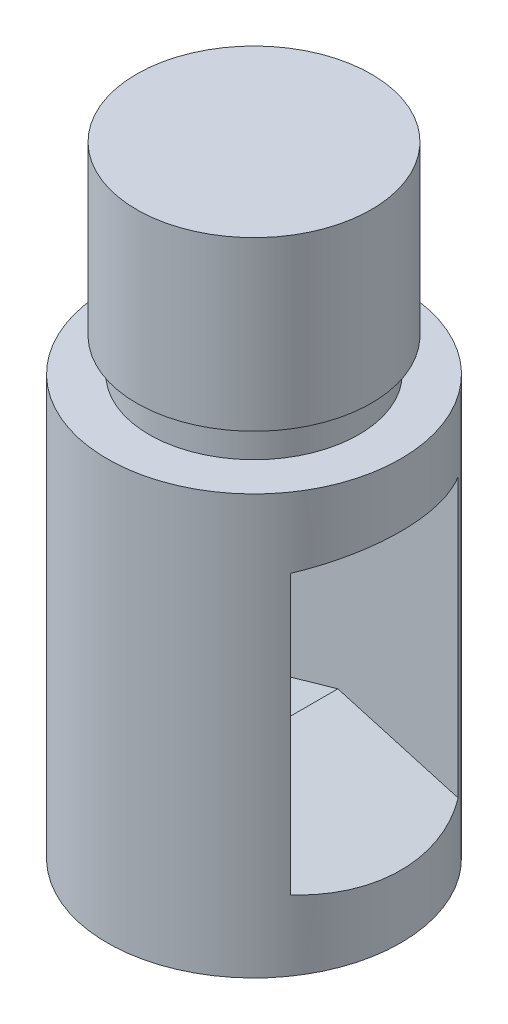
from build123d import *

# Parameters (mm, degrees)
CUT_EXTRUDE_1_DEPTH = 20


with BuildPart() as part:
    # Sketch 1 → Revolve 1 (revolve)
    with BuildSketch(Plane.XY):
        Polygon((0, -50), (-35, -50), (-35, 50), (-25, 50), (-25, 58), (-28, 58), (-28, 98), (0, 98), align=None)
    revolve(axis=Axis((0, 98, 0), (0, -1, 0)))

    # Sketch 2 → Cut-Extrude 1 (cut, symmetric)
    with BuildSketch(Plane.XY):
        Polygon((-35, 35), (0, 25), (35, 35), (35, -35), (0, -25), (-35, -35), align=None)
    extrude(amount=CUT_EXTRUDE_1_DEPTH, both=True, mode=Mode.SUBTRACT)


solid = part.part
